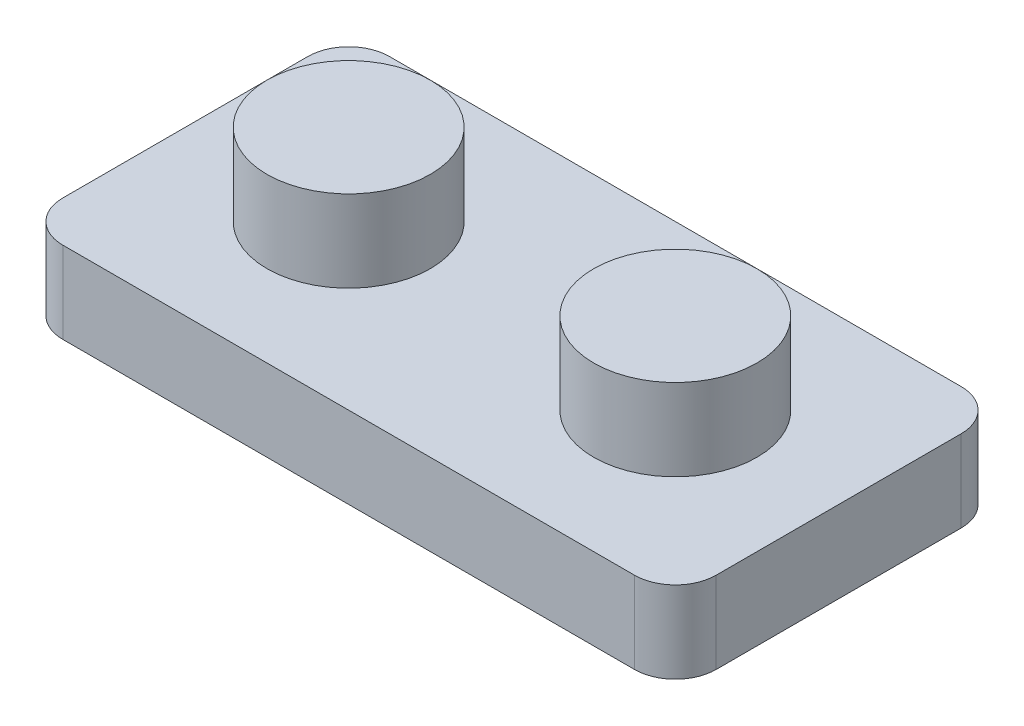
from build123d import *

# Parameters (mm, degrees)
SKETCH1_W      = 101.6
SKETCH1_H      = 50.8
EXTRUDE1_DEPTH = 12.7
SKETCH2_R      = 12.7
EXTRUDE2_DEPTH = 12.7
FILLET1_R      = 6.35


with BuildPart() as part:
    # Sketch1 → Extrude1 (new body)
    with BuildSketch(Plane(origin=(0, 0, 0), x_dir=(1, 0, 0), z_dir=(0, 1, 0))):
        with Locations((50.8, 25.4)):
            Rectangle(SKETCH1_W, SKETCH1_H)
    extrude(amount=EXTRUDE1_DEPTH)

    # Sketch2 → Extrude2 (add)
    with BuildSketch(Plane(origin=(0, 12.7, 0), x_dir=(-1, 0, 0), z_dir=(0, 1, 0))):
        with Locations(Location((-25.4, -25.4, 0), (0, 0, 270))):
            Circle(SKETCH2_R)
        with Locations(Location((-76.2, -25.4, 0), (0, 0, 270))):
            Circle(SKETCH2_R)
    extrude(amount=EXTRUDE2_DEPTH)

    # Fillet1
    fillet1_edges = [part.edges().sort_by_distance(p)[0] for p in [
        (0, 6.35, -50.8),
        (101.6, 6.35, -50.8),
        (101.6, 6.35, 0),
        (0, 6.35, 0),
    ]]
    fillet(fillet1_edges, radius=FILLET1_R)


solid = part.part
